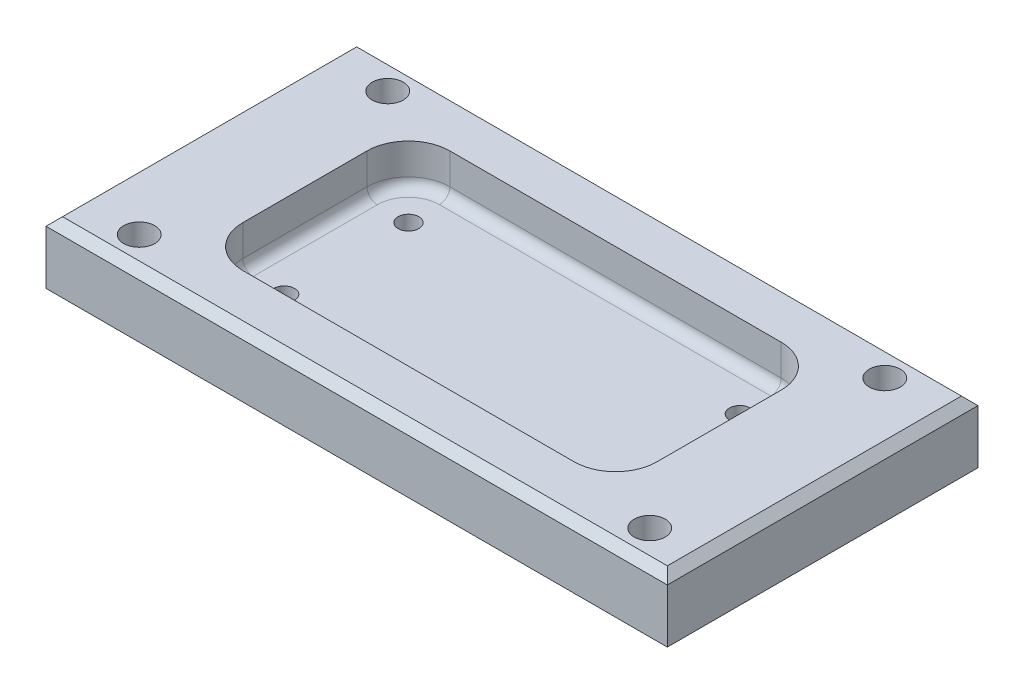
ISO-10303-21;
HEADER;
FILE_DESCRIPTION(('STEP AP214'),'2;1');
FILE_NAME('part.step','',(''),(''),'','','');
FILE_SCHEMA(('AUTOMOTIVE_DESIGN { 1 0 10303 214 1 1 1 1 }'));
ENDSEC;
DATA;
#1=APPLICATION_CONTEXT('core data for automotive mechanical design processes');
#2=APPLICATION_PROTOCOL_DEFINITION('international standard','automotive_design',2000,#1);
#3=PRODUCT_CONTEXT('',#1,'mechanical');
#4=PRODUCT('Part','Part','',(#3));
#5=PRODUCT_RELATED_PRODUCT_CATEGORY('part','',(#4));
#6=PRODUCT_DEFINITION_FORMATION('','',#4);
#7=PRODUCT_DEFINITION_CONTEXT('part definition',#1,'design');
#8=PRODUCT_DEFINITION('design','',#6,#7);
#9=PRODUCT_DEFINITION_SHAPE('','',#8);
#10=(LENGTH_UNIT() NAMED_UNIT(*) SI_UNIT(.MILLI.,.METRE.));
#11=(NAMED_UNIT(*) PLANE_ANGLE_UNIT() SI_UNIT($,.RADIAN.));
#12=(NAMED_UNIT(*) SI_UNIT($,.STERADIAN.) SOLID_ANGLE_UNIT());
#13=UNCERTAINTY_MEASURE_WITH_UNIT(LENGTH_MEASURE(1.E-05),#10,'distance_accuracy_value','');
#14=(GEOMETRIC_REPRESENTATION_CONTEXT(3) GLOBAL_UNCERTAINTY_ASSIGNED_CONTEXT((#13)) GLOBAL_UNIT_ASSIGNED_CONTEXT((#10,
#11,#12)) REPRESENTATION_CONTEXT('',''));
#15=CARTESIAN_POINT('',(0.,0.,0.));
#16=DIRECTION('',(0.,0.,1.));
#17=DIRECTION('',(1.,0.,0.));
#18=AXIS2_PLACEMENT_3D('',#15,#16,#17);
#19=CARTESIAN_POINT('',(75.,15.,37.5));
#20=DIRECTION('',(-1.,0.,0.));
#21=DIRECTION('',(0.,0.,1.));
#22=AXIS2_PLACEMENT_3D('',#19,#20,#21);
#23=PLANE('',#22);
#24=DIRECTION('',(0.,-1.,0.));
#25=VECTOR('',#24,1.);
#26=CARTESIAN_POINT('',(75.,15.,-37.5));
#27=LINE('',#26,#25);
#28=CARTESIAN_POINT('',(75.,13.,-37.5));
#29=VERTEX_POINT('',#28);
#30=CARTESIAN_POINT('',(75.,0.,-37.5));
#31=VERTEX_POINT('',#30);
#32=EDGE_CURVE('E157',#29,#31,#27,.T.);
#33=ORIENTED_EDGE('',*,*,#32,.F.);
#34=DIRECTION('',(0.,0.,1.));
#35=VECTOR('',#34,1.);
#36=CARTESIAN_POINT('',(75.,13.,37.5));
#37=LINE('',#36,#35);
#38=CARTESIAN_POINT('',(75.,13.,37.5));
#39=VERTEX_POINT('',#38);
#40=EDGE_CURVE('E288',#29,#39,#37,.T.);
#41=ORIENTED_EDGE('',*,*,#40,.T.);
#42=DIRECTION('',(0.,-1.,0.));
#43=VECTOR('',#42,1.);
#44=CARTESIAN_POINT('',(75.,15.,37.5));
#45=LINE('',#44,#43);
#46=CARTESIAN_POINT('',(75.,0.,37.5));
#47=VERTEX_POINT('',#46);
#48=EDGE_CURVE('E179',#39,#47,#45,.T.);
#49=ORIENTED_EDGE('',*,*,#48,.T.);
#50=DIRECTION('',(0.,0.,-1.));
#51=VECTOR('',#50,1.);
#52=CARTESIAN_POINT('',(75.,0.,37.5));
#53=LINE('',#52,#51);
#54=EDGE_CURVE('E175',#47,#31,#53,.T.);
#55=ORIENTED_EDGE('',*,*,#54,.T.);
#56=EDGE_LOOP('',(#33,#41,#49,#55));
#57=FACE_BOUND('',#56,.T.);
#58=ADVANCED_FACE('F32',(#57),#23,.F.);
#59=CARTESIAN_POINT('',(-75.,15.,-37.5));
#60=DIRECTION('',(0.,0.,1.));
#61=DIRECTION('',(1.,0.,0.));
#62=AXIS2_PLACEMENT_3D('',#59,#60,#61);
#63=PLANE('',#62);
#64=DIRECTION('',(0.,-1.,0.));
#65=VECTOR('',#64,1.);
#66=CARTESIAN_POINT('',(-75.,15.,-37.5));
#67=LINE('',#66,#65);
#68=CARTESIAN_POINT('',(-75.,13.,-37.5));
#69=VERTEX_POINT('',#68);
#70=CARTESIAN_POINT('',(-75.,0.,-37.5));
#71=VERTEX_POINT('',#70);
#72=EDGE_CURVE('E169',#69,#71,#67,.T.);
#73=ORIENTED_EDGE('',*,*,#72,.F.);
#74=DIRECTION('',(1.,0.,0.));
#75=VECTOR('',#74,1.);
#76=CARTESIAN_POINT('',(-75.,13.,-37.5));
#77=LINE('',#76,#75);
#78=EDGE_CURVE('E163',#69,#29,#77,.T.);
#79=ORIENTED_EDGE('',*,*,#78,.T.);
#80=ORIENTED_EDGE('',*,*,#32,.T.);
#81=DIRECTION('',(-1.,0.,0.));
#82=VECTOR('',#81,1.);
#83=CARTESIAN_POINT('',(-75.,0.,-37.5));
#84=LINE('',#83,#82);
#85=EDGE_CURVE('E160',#31,#71,#84,.T.);
#86=ORIENTED_EDGE('',*,*,#85,.T.);
#87=EDGE_LOOP('',(#73,#79,#80,#86));
#88=FACE_BOUND('',#87,.T.);
#89=ADVANCED_FACE('F159',(#88),#63,.F.);
#90=CARTESIAN_POINT('',(-75.,15.,37.5));
#91=DIRECTION('',(1.,0.,0.));
#92=DIRECTION('',(0.,0.,-1.));
#93=AXIS2_PLACEMENT_3D('',#90,#91,#92);
#94=PLANE('',#93);
#95=DIRECTION('',(0.,-1.,0.));
#96=VECTOR('',#95,1.);
#97=CARTESIAN_POINT('',(-75.,15.,37.5));
#98=LINE('',#97,#96);
#99=CARTESIAN_POINT('',(-75.,13.,37.5));
#100=VERTEX_POINT('',#99);
#101=CARTESIAN_POINT('',(-75.,0.,37.5));
#102=VERTEX_POINT('',#101);
#103=EDGE_CURVE('E192',#100,#102,#98,.T.);
#104=ORIENTED_EDGE('',*,*,#103,.F.);
#105=DIRECTION('',(0.,0.,-1.));
#106=VECTOR('',#105,1.);
#107=CARTESIAN_POINT('',(-75.,13.,37.5));
#108=LINE('',#107,#106);
#109=EDGE_CURVE('E41',#100,#69,#108,.T.);
#110=ORIENTED_EDGE('',*,*,#109,.T.);
#111=ORIENTED_EDGE('',*,*,#72,.T.);
#112=DIRECTION('',(0.,0.,1.));
#113=VECTOR('',#112,1.);
#114=CARTESIAN_POINT('',(-75.,0.,37.5));
#115=LINE('',#114,#113);
#116=EDGE_CURVE('E177',#71,#102,#115,.T.);
#117=ORIENTED_EDGE('',*,*,#116,.T.);
#118=EDGE_LOOP('',(#104,#110,#111,#117));
#119=FACE_BOUND('',#118,.T.);
#120=ADVANCED_FACE('F314',(#119),#94,.F.);
#121=CARTESIAN_POINT('',(-75.,15.,37.5));
#122=DIRECTION('',(0.,0.,-1.));
#123=DIRECTION('',(-1.,0.,0.));
#124=AXIS2_PLACEMENT_3D('',#121,#122,#123);
#125=PLANE('',#124);
#126=ORIENTED_EDGE('',*,*,#48,.F.);
#127=DIRECTION('',(-1.,0.,0.));
#128=VECTOR('',#127,1.);
#129=CARTESIAN_POINT('',(-75.,13.,37.5));
#130=LINE('',#129,#128);
#131=EDGE_CURVE('E11',#39,#100,#130,.T.);
#132=ORIENTED_EDGE('',*,*,#131,.T.);
#133=ORIENTED_EDGE('',*,*,#103,.T.);
#134=DIRECTION('',(1.,0.,0.));
#135=VECTOR('',#134,1.);
#136=CARTESIAN_POINT('',(-75.,0.,37.5));
#137=LINE('',#136,#135);
#138=EDGE_CURVE('E189',#102,#47,#137,.T.);
#139=ORIENTED_EDGE('',*,*,#138,.T.);
#140=EDGE_LOOP('',(#126,#132,#133,#139));
#141=FACE_BOUND('',#140,.T.);
#142=ADVANCED_FACE('F313',(#141),#125,.F.);
#143=CARTESIAN_POINT('',(75.,15.,-37.5));
#144=DIRECTION('',(0.,-1.,0.));
#145=DIRECTION('',(0.,0.,-1.));
#146=AXIS2_PLACEMENT_3D('',#143,#144,#145);
#147=PLANE('',#146);
#148=DIRECTION('',(1.,0.,0.));
#149=VECTOR('',#148,1.);
#150=CARTESIAN_POINT('',(75.,15.,35.5));
#151=LINE('',#150,#149);
#152=CARTESIAN_POINT('',(-73.,15.,35.5));
#153=VERTEX_POINT('',#152);
#154=CARTESIAN_POINT('',(73.,15.,35.5));
#155=VERTEX_POINT('',#154);
#156=EDGE_CURVE('E256',#153,#155,#151,.T.);
#157=ORIENTED_EDGE('',*,*,#156,.T.);
#158=DIRECTION('',(0.,0.,-1.));
#159=VECTOR('',#158,1.);
#160=CARTESIAN_POINT('',(73.,15.,-37.5));
#161=LINE('',#160,#159);
#162=CARTESIAN_POINT('',(73.,15.,-35.5));
#163=VERTEX_POINT('',#162);
#164=EDGE_CURVE('E285',#155,#163,#161,.T.);
#165=ORIENTED_EDGE('',*,*,#164,.T.);
#166=DIRECTION('',(-1.,0.,0.));
#167=VECTOR('',#166,1.);
#168=CARTESIAN_POINT('',(75.,15.,-35.5));
#169=LINE('',#168,#167);
#170=CARTESIAN_POINT('',(-73.,15.,-35.5));
#171=VERTEX_POINT('',#170);
#172=EDGE_CURVE('E283',#163,#171,#169,.T.);
#173=ORIENTED_EDGE('',*,*,#172,.T.);
#174=DIRECTION('',(0.,0.,1.));
#175=VECTOR('',#174,1.);
#176=CARTESIAN_POINT('',(-73.,15.,-37.5));
#177=LINE('',#176,#175);
#178=EDGE_CURVE('E281',#171,#153,#177,.T.);
#179=ORIENTED_EDGE('',*,*,#178,.T.);
#180=EDGE_LOOP('',(#157,#165,#173,#179));
#181=FACE_BOUND('',#180,.T.);
#182=CARTESIAN_POINT('',(62.9823856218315,15.,29.7355862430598));
#183=DIRECTION('',(0.,1.,0.));
#184=DIRECTION('',(0.,0.,1.));
#185=AXIS2_PLACEMENT_3D('',#182,#183,#184);
#186=CIRCLE('',#185,3.75000000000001);
#187=CARTESIAN_POINT('',(62.9823856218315,15.,33.4855862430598));
#188=VERTEX_POINT('',#187);
#189=EDGE_CURVE('E650',#188,#188,#186,.T.);
#190=ORIENTED_EDGE('',*,*,#189,.F.);
#191=EDGE_LOOP('',(#190));
#192=FACE_BOUND('',#191,.T.);
#193=CARTESIAN_POINT('',(60.,15.,-30.));
#194=DIRECTION('',(0.,1.,0.));
#195=DIRECTION('',(0.,0.,1.));
#196=AXIS2_PLACEMENT_3D('',#193,#194,#195);
#197=CIRCLE('',#196,3.75000000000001);
#198=CARTESIAN_POINT('',(60.,15.,-26.25));
#199=VERTEX_POINT('',#198);
#200=EDGE_CURVE('E654',#199,#199,#197,.T.);
#201=ORIENTED_EDGE('',*,*,#200,.F.);
#202=EDGE_LOOP('',(#201));
#203=FACE_BOUND('',#202,.T.);
#204=CARTESIAN_POINT('',(-60.,15.,30.));
#205=DIRECTION('',(0.,1.,0.));
#206=DIRECTION('',(0.,0.,1.));
#207=AXIS2_PLACEMENT_3D('',#204,#205,#206);
#208=CIRCLE('',#207,3.75);
#209=CARTESIAN_POINT('',(-60.,15.,33.75));
#210=VERTEX_POINT('',#209);
#211=EDGE_CURVE('E658',#210,#210,#208,.T.);
#212=ORIENTED_EDGE('',*,*,#211,.F.);
#213=EDGE_LOOP('',(#212));
#214=FACE_BOUND('',#213,.T.);
#215=CARTESIAN_POINT('',(-60.,15.,-30.));
#216=DIRECTION('',(0.,1.,0.));
#217=DIRECTION('',(0.,0.,1.));
#218=AXIS2_PLACEMENT_3D('',#215,#216,#217);
#219=CIRCLE('',#218,3.75000000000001);
#220=CARTESIAN_POINT('',(-60.,15.,-26.25));
#221=VERTEX_POINT('',#220);
#222=EDGE_CURVE('E662',#221,#221,#219,.T.);
#223=ORIENTED_EDGE('',*,*,#222,.F.);
#224=EDGE_LOOP('',(#223));
#225=FACE_BOUND('',#224,.T.);
#226=DIRECTION('',(-1.,0.,0.));
#227=VECTOR('',#226,1.);
#228=CARTESIAN_POINT('',(-50.,15.,-25.));
#229=LINE('',#228,#227);
#230=CARTESIAN_POINT('',(40.,15.,-25.));
#231=VERTEX_POINT('',#230);
#232=CARTESIAN_POINT('',(-40.,15.,-25.));
#233=VERTEX_POINT('',#232);
#234=EDGE_CURVE('E665',#231,#233,#229,.T.);
#235=ORIENTED_EDGE('',*,*,#234,.F.);
#236=CARTESIAN_POINT('',(40.,15.,-15.));
#237=DIRECTION('',(0.,-1.,0.));
#238=DIRECTION('',(0.,0.,-1.));
#239=AXIS2_PLACEMENT_3D('',#236,#237,#238);
#240=CIRCLE('',#239,10.);
#241=CARTESIAN_POINT('',(50.,15.,-15.));
#242=VERTEX_POINT('',#241);
#243=EDGE_CURVE('E218',#231,#242,#240,.T.);
#244=ORIENTED_EDGE('',*,*,#243,.T.);
#245=DIRECTION('',(0.,0.,-1.));
#246=VECTOR('',#245,1.);
#247=CARTESIAN_POINT('',(50.,15.,25.));
#248=LINE('',#247,#246);
#249=CARTESIAN_POINT('',(50.,15.,15.));
#250=VERTEX_POINT('',#249);
#251=EDGE_CURVE('E672',#250,#242,#248,.T.);
#252=ORIENTED_EDGE('',*,*,#251,.F.);
#253=CARTESIAN_POINT('',(40.,15.,15.));
#254=DIRECTION('',(0.,-1.,0.));
#255=DIRECTION('',(0.,0.,-1.));
#256=AXIS2_PLACEMENT_3D('',#253,#254,#255);
#257=CIRCLE('',#256,10.);
#258=CARTESIAN_POINT('',(40.,15.,25.));
#259=VERTEX_POINT('',#258);
#260=EDGE_CURVE('E216',#250,#259,#257,.T.);
#261=ORIENTED_EDGE('',*,*,#260,.T.);
#262=DIRECTION('',(1.,0.,0.));
#263=VECTOR('',#262,1.);
#264=CARTESIAN_POINT('',(-50.,15.,25.));
#265=LINE('',#264,#263);
#266=CARTESIAN_POINT('',(-40.,15.,25.));
#267=VERTEX_POINT('',#266);
#268=EDGE_CURVE('E181',#267,#259,#265,.T.);
#269=ORIENTED_EDGE('',*,*,#268,.F.);
#270=CARTESIAN_POINT('',(-40.,15.,15.));
#271=DIRECTION('',(0.,-1.,0.));
#272=DIRECTION('',(0.,0.,-1.));
#273=AXIS2_PLACEMENT_3D('',#270,#271,#272);
#274=CIRCLE('',#273,10.);
#275=CARTESIAN_POINT('',(-50.,15.,15.));
#276=VERTEX_POINT('',#275);
#277=EDGE_CURVE('E214',#267,#276,#274,.T.);
#278=ORIENTED_EDGE('',*,*,#277,.T.);
#279=DIRECTION('',(0.,0.,1.));
#280=VECTOR('',#279,1.);
#281=CARTESIAN_POINT('',(-50.,15.,25.));
#282=LINE('',#281,#280);
#283=CARTESIAN_POINT('',(-50.,15.,-15.));
#284=VERTEX_POINT('',#283);
#285=EDGE_CURVE('E184',#284,#276,#282,.T.);
#286=ORIENTED_EDGE('',*,*,#285,.F.);
#287=CARTESIAN_POINT('',(-40.,15.,-15.));
#288=DIRECTION('',(0.,-1.,0.));
#289=DIRECTION('',(0.,0.,-1.));
#290=AXIS2_PLACEMENT_3D('',#287,#288,#289);
#291=CIRCLE('',#290,10.);
#292=EDGE_CURVE('E220',#284,#233,#291,.T.);
#293=ORIENTED_EDGE('',*,*,#292,.T.);
#294=EDGE_LOOP('',(#235,#244,#252,#261,#269,#278,#286,#293));
#295=FACE_BOUND('',#294,.T.);
#296=ADVANCED_FACE('F321',(#181,#192,#203,#214,#225,#295),#147,.F.);
#297=CARTESIAN_POINT('',(75.,0.,-37.5));
#298=DIRECTION('',(0.,-1.,0.));
#299=DIRECTION('',(0.,0.,-1.));
#300=AXIS2_PLACEMENT_3D('',#297,#298,#299);
#301=PLANE('',#300);
#302=CARTESIAN_POINT('',(40.,0.,15.));
#303=DIRECTION('',(0.,-1.,0.));
#304=DIRECTION('',(0.,0.,-1.));
#305=AXIS2_PLACEMENT_3D('',#302,#303,#304);
#306=CIRCLE('',#305,2.5);
#307=CARTESIAN_POINT('',(40.,0.,12.5));
#308=VERTEX_POINT('',#307);
#309=EDGE_CURVE('E711',#308,#308,#306,.T.);
#310=ORIENTED_EDGE('',*,*,#309,.F.);
#311=EDGE_LOOP('',(#310));
#312=FACE_BOUND('',#311,.T.);
#313=CARTESIAN_POINT('',(40.,0.,-15.));
#314=DIRECTION('',(0.,-1.,0.));
#315=DIRECTION('',(0.,0.,-1.));
#316=AXIS2_PLACEMENT_3D('',#313,#314,#315);
#317=CIRCLE('',#316,2.5);
#318=CARTESIAN_POINT('',(40.,0.,-17.5));
#319=VERTEX_POINT('',#318);
#320=EDGE_CURVE('E705',#319,#319,#317,.T.);
#321=ORIENTED_EDGE('',*,*,#320,.F.);
#322=EDGE_LOOP('',(#321));
#323=FACE_BOUND('',#322,.T.);
#324=CARTESIAN_POINT('',(-40.,0.,15.));
#325=DIRECTION('',(0.,-1.,0.));
#326=DIRECTION('',(0.,0.,-1.));
#327=AXIS2_PLACEMENT_3D('',#324,#325,#326);
#328=CIRCLE('',#327,2.5);
#329=CARTESIAN_POINT('',(-40.,0.,12.5));
#330=VERTEX_POINT('',#329);
#331=EDGE_CURVE('E699',#330,#330,#328,.T.);
#332=ORIENTED_EDGE('',*,*,#331,.F.);
#333=EDGE_LOOP('',(#332));
#334=FACE_BOUND('',#333,.T.);
#335=CARTESIAN_POINT('',(-40.,0.,-15.));
#336=DIRECTION('',(0.,-1.,0.));
#337=DIRECTION('',(0.,0.,-1.));
#338=AXIS2_PLACEMENT_3D('',#335,#336,#337);
#339=CIRCLE('',#338,2.5);
#340=CARTESIAN_POINT('',(-40.,0.,-17.5));
#341=VERTEX_POINT('',#340);
#342=EDGE_CURVE('E691',#341,#341,#339,.T.);
#343=ORIENTED_EDGE('',*,*,#342,.F.);
#344=EDGE_LOOP('',(#343));
#345=FACE_BOUND('',#344,.T.);
#346=CARTESIAN_POINT('',(62.9823856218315,0.,29.7355862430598));
#347=DIRECTION('',(0.,1.,0.));
#348=DIRECTION('',(0.,0.,1.));
#349=AXIS2_PLACEMENT_3D('',#346,#347,#348);
#350=CIRCLE('',#349,3.75000000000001);
#351=CARTESIAN_POINT('',(62.9823856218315,0.,33.4855862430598));
#352=VERTEX_POINT('',#351);
#353=EDGE_CURVE('E687',#352,#352,#350,.T.);
#354=ORIENTED_EDGE('',*,*,#353,.T.);
#355=EDGE_LOOP('',(#354));
#356=FACE_BOUND('',#355,.T.);
#357=CARTESIAN_POINT('',(60.,0.,-30.));
#358=DIRECTION('',(0.,1.,0.));
#359=DIRECTION('',(0.,0.,1.));
#360=AXIS2_PLACEMENT_3D('',#357,#358,#359);
#361=CIRCLE('',#360,3.75000000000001);
#362=CARTESIAN_POINT('',(60.,0.,-26.25));
#363=VERTEX_POINT('',#362);
#364=EDGE_CURVE('E683',#363,#363,#361,.T.);
#365=ORIENTED_EDGE('',*,*,#364,.T.);
#366=EDGE_LOOP('',(#365));
#367=FACE_BOUND('',#366,.T.);
#368=CARTESIAN_POINT('',(-60.,0.,30.));
#369=DIRECTION('',(0.,1.,0.));
#370=DIRECTION('',(0.,0.,1.));
#371=AXIS2_PLACEMENT_3D('',#368,#369,#370);
#372=CIRCLE('',#371,3.75);
#373=CARTESIAN_POINT('',(-60.,0.,33.75));
#374=VERTEX_POINT('',#373);
#375=EDGE_CURVE('E679',#374,#374,#372,.T.);
#376=ORIENTED_EDGE('',*,*,#375,.T.);
#377=EDGE_LOOP('',(#376));
#378=FACE_BOUND('',#377,.T.);
#379=CARTESIAN_POINT('',(-60.,0.,-30.));
#380=DIRECTION('',(0.,1.,0.));
#381=DIRECTION('',(0.,0.,1.));
#382=AXIS2_PLACEMENT_3D('',#379,#380,#381);
#383=CIRCLE('',#382,3.75000000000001);
#384=CARTESIAN_POINT('',(-60.,0.,-26.25));
#385=VERTEX_POINT('',#384);
#386=EDGE_CURVE('E675',#385,#385,#383,.T.);
#387=ORIENTED_EDGE('',*,*,#386,.T.);
#388=EDGE_LOOP('',(#387));
#389=FACE_BOUND('',#388,.T.);
#390=ORIENTED_EDGE('',*,*,#54,.F.);
#391=ORIENTED_EDGE('',*,*,#138,.F.);
#392=ORIENTED_EDGE('',*,*,#116,.F.);
#393=ORIENTED_EDGE('',*,*,#85,.F.);
#394=EDGE_LOOP('',(#390,#391,#392,#393));
#395=FACE_BOUND('',#394,.T.);
#396=ADVANCED_FACE('F173',(#312,#323,#334,#345,#356,#367,#378,#389,#395),#301,.T.);
#397=CARTESIAN_POINT('',(50.,5.,25.));
#398=DIRECTION('',(1.,0.,0.));
#399=DIRECTION('',(0.,0.,-1.));
#400=AXIS2_PLACEMENT_3D('',#397,#398,#399);
#401=PLANE('',#400);
#402=DIRECTION('',(0.,1.,0.));
#403=VECTOR('',#402,1.);
#404=CARTESIAN_POINT('',(50.,5.,-15.));
#405=LINE('',#404,#403);
#406=CARTESIAN_POINT('',(50.,7.5,-15.));
#407=VERTEX_POINT('',#406);
#408=EDGE_CURVE('E204',#242,#407,#405,.F.);
#409=ORIENTED_EDGE('',*,*,#408,.T.);
#410=DIRECTION('',(0.,0.,-1.));
#411=VECTOR('',#410,1.);
#412=CARTESIAN_POINT('',(50.,7.5,15.));
#413=LINE('',#412,#411);
#414=CARTESIAN_POINT('',(50.,7.5,15.));
#415=VERTEX_POINT('',#414);
#416=EDGE_CURVE('E242',#407,#415,#413,.F.);
#417=ORIENTED_EDGE('',*,*,#416,.T.);
#418=DIRECTION('',(0.,1.,0.));
#419=VECTOR('',#418,1.);
#420=CARTESIAN_POINT('',(50.,15.,15.));
#421=LINE('',#420,#419);
#422=EDGE_CURVE('E207',#415,#250,#421,.T.);
#423=ORIENTED_EDGE('',*,*,#422,.T.);
#424=ORIENTED_EDGE('',*,*,#251,.T.);
#425=EDGE_LOOP('',(#409,#417,#423,#424));
#426=FACE_BOUND('',#425,.T.);
#427=ADVANCED_FACE('F532',(#426),#401,.F.);
#428=CARTESIAN_POINT('',(-50.,5.,25.));
#429=DIRECTION('',(0.,0.,1.));
#430=DIRECTION('',(1.,0.,0.));
#431=AXIS2_PLACEMENT_3D('',#428,#429,#430);
#432=PLANE('',#431);
#433=DIRECTION('',(0.,1.,0.));
#434=VECTOR('',#433,1.);
#435=CARTESIAN_POINT('',(40.,5.,25.));
#436=LINE('',#435,#434);
#437=CARTESIAN_POINT('',(40.,7.5,25.));
#438=VERTEX_POINT('',#437);
#439=EDGE_CURVE('E168',#259,#438,#436,.F.);
#440=ORIENTED_EDGE('',*,*,#439,.T.);
#441=DIRECTION('',(1.,0.,0.));
#442=VECTOR('',#441,1.);
#443=CARTESIAN_POINT('',(-40.,7.5,25.));
#444=LINE('',#443,#442);
#445=CARTESIAN_POINT('',(-40.,7.5,25.));
#446=VERTEX_POINT('',#445);
#447=EDGE_CURVE('E246',#438,#446,#444,.F.);
#448=ORIENTED_EDGE('',*,*,#447,.T.);
#449=DIRECTION('',(0.,1.,0.));
#450=VECTOR('',#449,1.);
#451=CARTESIAN_POINT('',(-40.,15.,25.));
#452=LINE('',#451,#450);
#453=EDGE_CURVE('E197',#446,#267,#452,.T.);
#454=ORIENTED_EDGE('',*,*,#453,.T.);
#455=ORIENTED_EDGE('',*,*,#268,.T.);
#456=EDGE_LOOP('',(#440,#448,#454,#455));
#457=FACE_BOUND('',#456,.T.);
#458=ADVANCED_FACE('F524',(#457),#432,.F.);
#459=CARTESIAN_POINT('',(-50.,5.,25.));
#460=DIRECTION('',(-1.,0.,0.));
#461=DIRECTION('',(0.,0.,1.));
#462=AXIS2_PLACEMENT_3D('',#459,#460,#461);
#463=PLANE('',#462);
#464=DIRECTION('',(0.,1.,0.));
#465=VECTOR('',#464,1.);
#466=CARTESIAN_POINT('',(-50.,5.,15.));
#467=LINE('',#466,#465);
#468=CARTESIAN_POINT('',(-50.,7.5,15.));
#469=VERTEX_POINT('',#468);
#470=EDGE_CURVE('E201',#276,#469,#467,.F.);
#471=ORIENTED_EDGE('',*,*,#470,.T.);
#472=DIRECTION('',(0.,0.,1.));
#473=VECTOR('',#472,1.);
#474=CARTESIAN_POINT('',(-50.,7.5,-15.));
#475=LINE('',#474,#473);
#476=CARTESIAN_POINT('',(-50.,7.5,-15.));
#477=VERTEX_POINT('',#476);
#478=EDGE_CURVE('E250',#469,#477,#475,.F.);
#479=ORIENTED_EDGE('',*,*,#478,.T.);
#480=DIRECTION('',(0.,1.,0.));
#481=VECTOR('',#480,1.);
#482=CARTESIAN_POINT('',(-50.,15.,-15.));
#483=LINE('',#482,#481);
#484=EDGE_CURVE('E199',#477,#284,#483,.T.);
#485=ORIENTED_EDGE('',*,*,#484,.T.);
#486=ORIENTED_EDGE('',*,*,#285,.T.);
#487=EDGE_LOOP('',(#471,#479,#485,#486));
#488=FACE_BOUND('',#487,.T.);
#489=ADVANCED_FACE('F516',(#488),#463,.F.);
#490=CARTESIAN_POINT('',(-50.,5.,-25.));
#491=DIRECTION('',(0.,0.,-1.));
#492=DIRECTION('',(-1.,0.,0.));
#493=AXIS2_PLACEMENT_3D('',#490,#491,#492);
#494=PLANE('',#493);
#495=DIRECTION('',(0.,1.,0.));
#496=VECTOR('',#495,1.);
#497=CARTESIAN_POINT('',(-40.,5.,-25.));
#498=LINE('',#497,#496);
#499=CARTESIAN_POINT('',(-40.,7.5,-25.));
#500=VERTEX_POINT('',#499);
#501=EDGE_CURVE('E209',#233,#500,#498,.F.);
#502=ORIENTED_EDGE('',*,*,#501,.T.);
#503=DIRECTION('',(-1.,0.,0.));
#504=VECTOR('',#503,1.);
#505=CARTESIAN_POINT('',(40.,7.5,-25.));
#506=LINE('',#505,#504);
#507=CARTESIAN_POINT('',(40.,7.5,-25.));
#508=VERTEX_POINT('',#507);
#509=EDGE_CURVE('E254',#500,#508,#506,.F.);
#510=ORIENTED_EDGE('',*,*,#509,.T.);
#511=DIRECTION('',(0.,1.,0.));
#512=VECTOR('',#511,1.);
#513=CARTESIAN_POINT('',(40.,15.,-25.));
#514=LINE('',#513,#512);
#515=EDGE_CURVE('E212',#508,#231,#514,.T.);
#516=ORIENTED_EDGE('',*,*,#515,.T.);
#517=ORIENTED_EDGE('',*,*,#234,.T.);
#518=EDGE_LOOP('',(#502,#510,#516,#517));
#519=FACE_BOUND('',#518,.T.);
#520=ADVANCED_FACE('F508',(#519),#494,.F.);
#521=CARTESIAN_POINT('',(50.,5.,-25.));
#522=DIRECTION('',(0.,-1.,0.));
#523=DIRECTION('',(0.,0.,-1.));
#524=AXIS2_PLACEMENT_3D('',#521,#522,#523);
#525=PLANE('',#524);
#526=DIRECTION('',(0.,0.,-1.));
#527=VECTOR('',#526,1.);
#528=CARTESIAN_POINT('',(47.5,5.,-15.));
#529=LINE('',#528,#527);
#530=CARTESIAN_POINT('',(47.5,5.,15.));
#531=VERTEX_POINT('',#530);
#532=CARTESIAN_POINT('',(47.5,5.,-15.));
#533=VERTEX_POINT('',#532);
#534=EDGE_CURVE('E234',#531,#533,#529,.T.);
#535=ORIENTED_EDGE('',*,*,#534,.T.);
#536=CARTESIAN_POINT('',(40.,5.,-15.));
#537=DIRECTION('',(0.,-1.,0.));
#538=DIRECTION('',(0.,0.,-1.));
#539=AXIS2_PLACEMENT_3D('',#536,#537,#538);
#540=CIRCLE('',#539,7.5);
#541=CARTESIAN_POINT('',(40.,5.,-22.5));
#542=VERTEX_POINT('',#541);
#543=EDGE_CURVE('E236',#533,#542,#540,.F.);
#544=ORIENTED_EDGE('',*,*,#543,.T.);
#545=DIRECTION('',(-1.,0.,0.));
#546=VECTOR('',#545,1.);
#547=CARTESIAN_POINT('',(-40.,5.,-22.5));
#548=LINE('',#547,#546);
#549=CARTESIAN_POINT('',(-40.,5.,-22.5));
#550=VERTEX_POINT('',#549);
#551=EDGE_CURVE('E222',#542,#550,#548,.T.);
#552=ORIENTED_EDGE('',*,*,#551,.T.);
#553=CARTESIAN_POINT('',(-40.,5.,-15.));
#554=DIRECTION('',(0.,-1.,0.));
#555=DIRECTION('',(0.,0.,-1.));
#556=AXIS2_PLACEMENT_3D('',#553,#554,#555);
#557=CIRCLE('',#556,7.5);
#558=CARTESIAN_POINT('',(-47.5,5.,-15.));
#559=VERTEX_POINT('',#558);
#560=EDGE_CURVE('E224',#550,#559,#557,.F.);
#561=ORIENTED_EDGE('',*,*,#560,.T.);
#562=DIRECTION('',(0.,0.,1.));
#563=VECTOR('',#562,1.);
#564=CARTESIAN_POINT('',(-47.5,5.,15.));
#565=LINE('',#564,#563);
#566=CARTESIAN_POINT('',(-47.5,5.,15.));
#567=VERTEX_POINT('',#566);
#568=EDGE_CURVE('E226',#559,#567,#565,.T.);
#569=ORIENTED_EDGE('',*,*,#568,.T.);
#570=CARTESIAN_POINT('',(-40.,5.,15.));
#571=DIRECTION('',(0.,-1.,0.));
#572=DIRECTION('',(0.,0.,-1.));
#573=AXIS2_PLACEMENT_3D('',#570,#571,#572);
#574=CIRCLE('',#573,7.5);
#575=CARTESIAN_POINT('',(-40.,5.,22.5));
#576=VERTEX_POINT('',#575);
#577=EDGE_CURVE('E228',#567,#576,#574,.F.);
#578=ORIENTED_EDGE('',*,*,#577,.T.);
#579=DIRECTION('',(1.,0.,0.));
#580=VECTOR('',#579,1.);
#581=CARTESIAN_POINT('',(40.,5.,22.5));
#582=LINE('',#581,#580);
#583=CARTESIAN_POINT('',(40.,5.,22.5));
#584=VERTEX_POINT('',#583);
#585=EDGE_CURVE('E230',#576,#584,#582,.T.);
#586=ORIENTED_EDGE('',*,*,#585,.T.);
#587=CARTESIAN_POINT('',(40.,5.,15.));
#588=DIRECTION('',(0.,-1.,0.));
#589=DIRECTION('',(0.,0.,-1.));
#590=AXIS2_PLACEMENT_3D('',#587,#588,#589);
#591=CIRCLE('',#590,7.5);
#592=EDGE_CURVE('E232',#584,#531,#591,.F.);
#593=ORIENTED_EDGE('',*,*,#592,.T.);
#594=EDGE_LOOP('',(#535,#544,#552,#561,#569,#578,#586,#593));
#595=FACE_BOUND('',#594,.T.);
#596=CARTESIAN_POINT('',(40.,5.,15.));
#597=DIRECTION('',(0.,1.,0.));
#598=DIRECTION('',(0.,0.,1.));
#599=AXIS2_PLACEMENT_3D('',#596,#597,#598);
#600=CIRCLE('',#599,2.5);
#601=CARTESIAN_POINT('',(40.,5.,17.5));
#602=VERTEX_POINT('',#601);
#603=EDGE_CURVE('E279',#602,#602,#600,.T.);
#604=ORIENTED_EDGE('',*,*,#603,.F.);
#605=EDGE_LOOP('',(#604));
#606=FACE_BOUND('',#605,.T.);
#607=CARTESIAN_POINT('',(40.,5.,-15.));
#608=DIRECTION('',(0.,1.,0.));
#609=DIRECTION('',(0.,0.,1.));
#610=AXIS2_PLACEMENT_3D('',#607,#608,#609);
#611=CIRCLE('',#610,2.5);
#612=CARTESIAN_POINT('',(40.,5.,-12.5));
#613=VERTEX_POINT('',#612);
#614=EDGE_CURVE('E708',#613,#613,#611,.T.);
#615=ORIENTED_EDGE('',*,*,#614,.F.);
#616=EDGE_LOOP('',(#615));
#617=FACE_BOUND('',#616,.T.);
#618=CARTESIAN_POINT('',(-40.,5.,15.));
#619=DIRECTION('',(0.,1.,0.));
#620=DIRECTION('',(0.,0.,1.));
#621=AXIS2_PLACEMENT_3D('',#618,#619,#620);
#622=CIRCLE('',#621,2.5);
#623=CARTESIAN_POINT('',(-40.,5.,17.5));
#624=VERTEX_POINT('',#623);
#625=EDGE_CURVE('E702',#624,#624,#622,.T.);
#626=ORIENTED_EDGE('',*,*,#625,.F.);
#627=EDGE_LOOP('',(#626));
#628=FACE_BOUND('',#627,.T.);
#629=CARTESIAN_POINT('',(-40.,5.,-15.));
#630=DIRECTION('',(0.,1.,0.));
#631=DIRECTION('',(0.,0.,1.));
#632=AXIS2_PLACEMENT_3D('',#629,#630,#631);
#633=CIRCLE('',#632,2.5);
#634=CARTESIAN_POINT('',(-40.,5.,-12.5));
#635=VERTEX_POINT('',#634);
#636=EDGE_CURVE('E696',#635,#635,#633,.T.);
#637=ORIENTED_EDGE('',*,*,#636,.F.);
#638=EDGE_LOOP('',(#637));
#639=FACE_BOUND('',#638,.T.);
#640=ADVANCED_FACE('F501',(#595,#606,#617,#628,#639),#525,.F.);
#641=CARTESIAN_POINT('',(-60.,0.,-30.));
#642=DIRECTION('',(0.,1.,0.));
#643=DIRECTION('',(0.,0.,1.));
#644=AXIS2_PLACEMENT_3D('',#641,#642,#643);
#645=CYLINDRICAL_SURFACE('',#644,3.75000000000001);
#646=ORIENTED_EDGE('',*,*,#386,.F.);
#647=EDGE_LOOP('',(#646));
#648=FACE_BOUND('',#647,.T.);
#649=ORIENTED_EDGE('',*,*,#222,.T.);
#650=EDGE_LOOP('',(#649));
#651=FACE_BOUND('',#650,.T.);
#652=ADVANCED_FACE('F493',(#648,#651),#645,.F.);
#653=CARTESIAN_POINT('',(-60.,0.,30.));
#654=DIRECTION('',(0.,1.,0.));
#655=DIRECTION('',(0.,0.,1.));
#656=AXIS2_PLACEMENT_3D('',#653,#654,#655);
#657=CYLINDRICAL_SURFACE('',#656,3.75);
#658=ORIENTED_EDGE('',*,*,#375,.F.);
#659=EDGE_LOOP('',(#658));
#660=FACE_BOUND('',#659,.T.);
#661=ORIENTED_EDGE('',*,*,#211,.T.);
#662=EDGE_LOOP('',(#661));
#663=FACE_BOUND('',#662,.T.);
#664=ADVANCED_FACE('F485',(#660,#663),#657,.F.);
#665=CARTESIAN_POINT('',(60.,0.,-30.));
#666=DIRECTION('',(0.,1.,0.));
#667=DIRECTION('',(0.,0.,1.));
#668=AXIS2_PLACEMENT_3D('',#665,#666,#667);
#669=CYLINDRICAL_SURFACE('',#668,3.75000000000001);
#670=ORIENTED_EDGE('',*,*,#364,.F.);
#671=EDGE_LOOP('',(#670));
#672=FACE_BOUND('',#671,.T.);
#673=ORIENTED_EDGE('',*,*,#200,.T.);
#674=EDGE_LOOP('',(#673));
#675=FACE_BOUND('',#674,.T.);
#676=ADVANCED_FACE('F477',(#672,#675),#669,.F.);
#677=CARTESIAN_POINT('',(62.9823856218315,0.,29.7355862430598));
#678=DIRECTION('',(0.,1.,0.));
#679=DIRECTION('',(0.,0.,1.));
#680=AXIS2_PLACEMENT_3D('',#677,#678,#679);
#681=CYLINDRICAL_SURFACE('',#680,3.75000000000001);
#682=ORIENTED_EDGE('',*,*,#353,.F.);
#683=EDGE_LOOP('',(#682));
#684=FACE_BOUND('',#683,.T.);
#685=ORIENTED_EDGE('',*,*,#189,.T.);
#686=EDGE_LOOP('',(#685));
#687=FACE_BOUND('',#686,.T.);
#688=ADVANCED_FACE('F333',(#684,#687),#681,.F.);
#689=CARTESIAN_POINT('',(-40.,5.,15.));
#690=DIRECTION('',(0.,-1.,0.));
#691=DIRECTION('',(0.,0.,-1.));
#692=AXIS2_PLACEMENT_3D('',#689,#690,#691);
#693=CYLINDRICAL_SURFACE('',#692,10.);
#694=ORIENTED_EDGE('',*,*,#453,.F.);
#695=CARTESIAN_POINT('',(-40.,7.5,15.));
#696=DIRECTION('',(0.,-1.,0.));
#697=DIRECTION('',(0.,0.,-1.));
#698=AXIS2_PLACEMENT_3D('',#695,#696,#697);
#699=CIRCLE('',#698,10.);
#700=EDGE_CURVE('E248',#446,#469,#699,.T.);
#701=ORIENTED_EDGE('',*,*,#700,.T.);
#702=ORIENTED_EDGE('',*,*,#470,.F.);
#703=ORIENTED_EDGE('',*,*,#277,.F.);
#704=EDGE_LOOP('',(#694,#701,#702,#703));
#705=FACE_BOUND('',#704,.T.);
#706=ADVANCED_FACE('F329',(#705),#693,.F.);
#707=CARTESIAN_POINT('',(40.,5.,15.));
#708=DIRECTION('',(0.,-1.,0.));
#709=DIRECTION('',(0.,0.,-1.));
#710=AXIS2_PLACEMENT_3D('',#707,#708,#709);
#711=CYLINDRICAL_SURFACE('',#710,10.);
#712=ORIENTED_EDGE('',*,*,#422,.F.);
#713=CARTESIAN_POINT('',(40.,7.5,15.));
#714=DIRECTION('',(0.,-1.,0.));
#715=DIRECTION('',(0.,0.,-1.));
#716=AXIS2_PLACEMENT_3D('',#713,#714,#715);
#717=CIRCLE('',#716,10.);
#718=EDGE_CURVE('E244',#415,#438,#717,.T.);
#719=ORIENTED_EDGE('',*,*,#718,.T.);
#720=ORIENTED_EDGE('',*,*,#439,.F.);
#721=ORIENTED_EDGE('',*,*,#260,.F.);
#722=EDGE_LOOP('',(#712,#719,#720,#721));
#723=FACE_BOUND('',#722,.T.);
#724=ADVANCED_FACE('F332',(#723),#711,.F.);
#725=CARTESIAN_POINT('',(40.,5.,-15.));
#726=DIRECTION('',(0.,-1.,0.));
#727=DIRECTION('',(0.,0.,-1.));
#728=AXIS2_PLACEMENT_3D('',#725,#726,#727);
#729=CYLINDRICAL_SURFACE('',#728,10.);
#730=ORIENTED_EDGE('',*,*,#515,.F.);
#731=CARTESIAN_POINT('',(40.,7.5,-15.));
#732=DIRECTION('',(0.,-1.,0.));
#733=DIRECTION('',(0.,0.,-1.));
#734=AXIS2_PLACEMENT_3D('',#731,#732,#733);
#735=CIRCLE('',#734,10.);
#736=EDGE_CURVE('E239',#508,#407,#735,.T.);
#737=ORIENTED_EDGE('',*,*,#736,.T.);
#738=ORIENTED_EDGE('',*,*,#408,.F.);
#739=ORIENTED_EDGE('',*,*,#243,.F.);
#740=EDGE_LOOP('',(#730,#737,#738,#739));
#741=FACE_BOUND('',#740,.T.);
#742=ADVANCED_FACE('F337',(#741),#729,.F.);
#743=CARTESIAN_POINT('',(-40.,5.,-15.));
#744=DIRECTION('',(0.,-1.,0.));
#745=DIRECTION('',(0.,0.,-1.));
#746=AXIS2_PLACEMENT_3D('',#743,#744,#745);
#747=CYLINDRICAL_SURFACE('',#746,10.);
#748=ORIENTED_EDGE('',*,*,#484,.F.);
#749=CARTESIAN_POINT('',(-40.,7.5,-15.));
#750=DIRECTION('',(0.,-1.,0.));
#751=DIRECTION('',(0.,0.,-1.));
#752=AXIS2_PLACEMENT_3D('',#749,#750,#751);
#753=CIRCLE('',#752,10.);
#754=EDGE_CURVE('E252',#477,#500,#753,.T.);
#755=ORIENTED_EDGE('',*,*,#754,.T.);
#756=ORIENTED_EDGE('',*,*,#501,.F.);
#757=ORIENTED_EDGE('',*,*,#292,.F.);
#758=EDGE_LOOP('',(#748,#755,#756,#757));
#759=FACE_BOUND('',#758,.T.);
#760=ADVANCED_FACE('F341',(#759),#747,.F.);
#761=CARTESIAN_POINT('',(-40.,-5.,-15.));
#762=DIRECTION('',(0.,1.,0.));
#763=DIRECTION('',(0.,0.,1.));
#764=AXIS2_PLACEMENT_3D('',#761,#762,#763);
#765=CYLINDRICAL_SURFACE('',#764,2.5);
#766=ORIENTED_EDGE('',*,*,#342,.T.);
#767=EDGE_LOOP('',(#766));
#768=FACE_BOUND('',#767,.T.);
#769=ORIENTED_EDGE('',*,*,#636,.T.);
#770=EDGE_LOOP('',(#769));
#771=FACE_BOUND('',#770,.T.);
#772=ADVANCED_FACE('F345',(#768,#771),#765,.F.);
#773=CARTESIAN_POINT('',(-40.,-5.,15.));
#774=DIRECTION('',(0.,1.,0.));
#775=DIRECTION('',(0.,0.,1.));
#776=AXIS2_PLACEMENT_3D('',#773,#774,#775);
#777=CYLINDRICAL_SURFACE('',#776,2.5);
#778=ORIENTED_EDGE('',*,*,#331,.T.);
#779=EDGE_LOOP('',(#778));
#780=FACE_BOUND('',#779,.T.);
#781=ORIENTED_EDGE('',*,*,#625,.T.);
#782=EDGE_LOOP('',(#781));
#783=FACE_BOUND('',#782,.T.);
#784=ADVANCED_FACE('F438',(#780,#783),#777,.F.);
#785=CARTESIAN_POINT('',(40.,-5.,-15.));
#786=DIRECTION('',(0.,1.,0.));
#787=DIRECTION('',(0.,0.,1.));
#788=AXIS2_PLACEMENT_3D('',#785,#786,#787);
#789=CYLINDRICAL_SURFACE('',#788,2.5);
#790=ORIENTED_EDGE('',*,*,#320,.T.);
#791=EDGE_LOOP('',(#790));
#792=FACE_BOUND('',#791,.T.);
#793=ORIENTED_EDGE('',*,*,#614,.T.);
#794=EDGE_LOOP('',(#793));
#795=FACE_BOUND('',#794,.T.);
#796=ADVANCED_FACE('F429',(#792,#795),#789,.F.);
#797=CARTESIAN_POINT('',(40.,-5.,15.));
#798=DIRECTION('',(0.,1.,0.));
#799=DIRECTION('',(0.,0.,1.));
#800=AXIS2_PLACEMENT_3D('',#797,#798,#799);
#801=CYLINDRICAL_SURFACE('',#800,2.5);
#802=ORIENTED_EDGE('',*,*,#309,.T.);
#803=EDGE_LOOP('',(#802));
#804=FACE_BOUND('',#803,.T.);
#805=ORIENTED_EDGE('',*,*,#603,.T.);
#806=EDGE_LOOP('',(#805));
#807=FACE_BOUND('',#806,.T.);
#808=ADVANCED_FACE('F378',(#804,#807),#801,.F.);
#809=CARTESIAN_POINT('',(-40.,7.5,15.));
#810=DIRECTION('',(0.,-1.,0.));
#811=DIRECTION('',(0.,0.,-1.));
#812=AXIS2_PLACEMENT_3D('',#809,#810,#811);
#813=TOROIDAL_SURFACE('',#812,7.5,2.5);
#814=CARTESIAN_POINT('',(-47.5,7.5,15.));
#815=DIRECTION('',(0.,0.,1.));
#816=DIRECTION('',(1.,0.,0.));
#817=AXIS2_PLACEMENT_3D('',#814,#815,#816);
#818=CIRCLE('',#817,2.5);
#819=EDGE_CURVE('E273',#469,#567,#818,.T.);
#820=ORIENTED_EDGE('',*,*,#819,.F.);
#821=ORIENTED_EDGE('',*,*,#700,.F.);
#822=CARTESIAN_POINT('',(-40.,7.5,22.5));
#823=DIRECTION('',(-1.,0.,0.));
#824=DIRECTION('',(0.,0.,1.));
#825=AXIS2_PLACEMENT_3D('',#822,#823,#824);
#826=CIRCLE('',#825,2.5);
#827=EDGE_CURVE('E276',#576,#446,#826,.T.);
#828=ORIENTED_EDGE('',*,*,#827,.F.);
#829=ORIENTED_EDGE('',*,*,#577,.F.);
#830=EDGE_LOOP('',(#820,#821,#828,#829));
#831=FACE_BOUND('',#830,.T.);
#832=ADVANCED_FACE('F374',(#831),#813,.F.);
#833=CARTESIAN_POINT('',(50.,7.5,22.5));
#834=DIRECTION('',(-1.,0.,0.));
#835=DIRECTION('',(0.,0.,1.));
#836=AXIS2_PLACEMENT_3D('',#833,#834,#835);
#837=CYLINDRICAL_SURFACE('',#836,2.5);
#838=ORIENTED_EDGE('',*,*,#827,.T.);
#839=ORIENTED_EDGE('',*,*,#447,.F.);
#840=CARTESIAN_POINT('',(40.,7.5,22.5));
#841=DIRECTION('',(-1.,0.,0.));
#842=DIRECTION('',(0.,0.,1.));
#843=AXIS2_PLACEMENT_3D('',#840,#841,#842);
#844=CIRCLE('',#843,2.5);
#845=EDGE_CURVE('E270',#584,#438,#844,.T.);
#846=ORIENTED_EDGE('',*,*,#845,.F.);
#847=ORIENTED_EDGE('',*,*,#585,.F.);
#848=EDGE_LOOP('',(#838,#839,#846,#847));
#849=FACE_BOUND('',#848,.T.);
#850=ADVANCED_FACE('F370',(#849),#837,.F.);
#851=CARTESIAN_POINT('',(-47.5,7.5,-25.));
#852=DIRECTION('',(0.,0.,-1.));
#853=DIRECTION('',(-1.,0.,0.));
#854=AXIS2_PLACEMENT_3D('',#851,#852,#853);
#855=CYLINDRICAL_SURFACE('',#854,2.5);
#856=ORIENTED_EDGE('',*,*,#819,.T.);
#857=ORIENTED_EDGE('',*,*,#568,.F.);
#858=CARTESIAN_POINT('',(-47.5,7.5,-15.));
#859=DIRECTION('',(0.,0.,1.));
#860=DIRECTION('',(1.,0.,0.));
#861=AXIS2_PLACEMENT_3D('',#858,#859,#860);
#862=CIRCLE('',#861,2.5);
#863=EDGE_CURVE('E267',#477,#559,#862,.T.);
#864=ORIENTED_EDGE('',*,*,#863,.F.);
#865=ORIENTED_EDGE('',*,*,#478,.F.);
#866=EDGE_LOOP('',(#856,#857,#864,#865));
#867=FACE_BOUND('',#866,.T.);
#868=ADVANCED_FACE('F366',(#867),#855,.F.);
#869=CARTESIAN_POINT('',(40.,7.5,15.));
#870=DIRECTION('',(0.,-1.,0.));
#871=DIRECTION('',(0.,0.,-1.));
#872=AXIS2_PLACEMENT_3D('',#869,#870,#871);
#873=TOROIDAL_SURFACE('',#872,7.5,2.5);
#874=ORIENTED_EDGE('',*,*,#845,.T.);
#875=ORIENTED_EDGE('',*,*,#718,.F.);
#876=CARTESIAN_POINT('',(47.5,7.5,15.));
#877=DIRECTION('',(0.,0.,1.));
#878=DIRECTION('',(1.,0.,0.));
#879=AXIS2_PLACEMENT_3D('',#876,#877,#878);
#880=CIRCLE('',#879,2.5);
#881=EDGE_CURVE('E264',#531,#415,#880,.T.);
#882=ORIENTED_EDGE('',*,*,#881,.F.);
#883=ORIENTED_EDGE('',*,*,#592,.F.);
#884=EDGE_LOOP('',(#874,#875,#882,#883));
#885=FACE_BOUND('',#884,.T.);
#886=ADVANCED_FACE('F362',(#885),#873,.F.);
#887=CARTESIAN_POINT('',(-40.,7.5,-15.));
#888=DIRECTION('',(0.,-1.,0.));
#889=DIRECTION('',(0.,0.,-1.));
#890=AXIS2_PLACEMENT_3D('',#887,#888,#889);
#891=TOROIDAL_SURFACE('',#890,7.5,2.5);
#892=ORIENTED_EDGE('',*,*,#863,.T.);
#893=ORIENTED_EDGE('',*,*,#560,.F.);
#894=CARTESIAN_POINT('',(-40.,7.5,-22.5));
#895=DIRECTION('',(-1.,0.,0.));
#896=DIRECTION('',(0.,0.,1.));
#897=AXIS2_PLACEMENT_3D('',#894,#895,#896);
#898=CIRCLE('',#897,2.5);
#899=EDGE_CURVE('E261',#500,#550,#898,.T.);
#900=ORIENTED_EDGE('',*,*,#899,.F.);
#901=ORIENTED_EDGE('',*,*,#754,.F.);
#902=EDGE_LOOP('',(#892,#893,#900,#901));
#903=FACE_BOUND('',#902,.T.);
#904=ADVANCED_FACE('F358',(#903),#891,.F.);
#905=CARTESIAN_POINT('',(47.5,7.5,-25.));
#906=DIRECTION('',(0.,0.,1.));
#907=DIRECTION('',(1.,0.,0.));
#908=AXIS2_PLACEMENT_3D('',#905,#906,#907);
#909=CYLINDRICAL_SURFACE('',#908,2.5);
#910=ORIENTED_EDGE('',*,*,#881,.T.);
#911=ORIENTED_EDGE('',*,*,#416,.F.);
#912=CARTESIAN_POINT('',(47.5,7.5,-15.));
#913=DIRECTION('',(0.,0.,1.));
#914=DIRECTION('',(1.,0.,0.));
#915=AXIS2_PLACEMENT_3D('',#912,#913,#914);
#916=CIRCLE('',#915,2.5);
#917=EDGE_CURVE('E259',#533,#407,#916,.T.);
#918=ORIENTED_EDGE('',*,*,#917,.F.);
#919=ORIENTED_EDGE('',*,*,#534,.F.);
#920=EDGE_LOOP('',(#910,#911,#918,#919));
#921=FACE_BOUND('',#920,.T.);
#922=ADVANCED_FACE('F354',(#921),#909,.F.);
#923=CARTESIAN_POINT('',(50.,7.5,-22.5));
#924=DIRECTION('',(1.,0.,0.));
#925=DIRECTION('',(0.,0.,-1.));
#926=AXIS2_PLACEMENT_3D('',#923,#924,#925);
#927=CYLINDRICAL_SURFACE('',#926,2.5);
#928=ORIENTED_EDGE('',*,*,#899,.T.);
#929=ORIENTED_EDGE('',*,*,#551,.F.);
#930=CARTESIAN_POINT('',(40.,7.5,-22.5));
#931=DIRECTION('',(-1.,0.,0.));
#932=DIRECTION('',(0.,0.,1.));
#933=AXIS2_PLACEMENT_3D('',#930,#931,#932);
#934=CIRCLE('',#933,2.5);
#935=EDGE_CURVE('E257',#508,#542,#934,.T.);
#936=ORIENTED_EDGE('',*,*,#935,.F.);
#937=ORIENTED_EDGE('',*,*,#509,.F.);
#938=EDGE_LOOP('',(#928,#929,#936,#937));
#939=FACE_BOUND('',#938,.T.);
#940=ADVANCED_FACE('F350',(#939),#927,.F.);
#941=CARTESIAN_POINT('',(40.,7.5,-15.));
#942=DIRECTION('',(0.,-1.,0.));
#943=DIRECTION('',(0.,0.,-1.));
#944=AXIS2_PLACEMENT_3D('',#941,#942,#943);
#945=TOROIDAL_SURFACE('',#944,7.5,2.5);
#946=ORIENTED_EDGE('',*,*,#917,.T.);
#947=ORIENTED_EDGE('',*,*,#736,.F.);
#948=ORIENTED_EDGE('',*,*,#935,.T.);
#949=ORIENTED_EDGE('',*,*,#543,.F.);
#950=EDGE_LOOP('',(#946,#947,#948,#949));
#951=FACE_BOUND('',#950,.T.);
#952=ADVANCED_FACE('F347',(#951),#945,.F.);
#953=CARTESIAN_POINT('',(-73.,15.,-37.5));
#954=DIRECTION('',(0.707106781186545,-0.70710678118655,0.));
#955=DIRECTION('',(0.70710678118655,0.707106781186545,0.));
#956=AXIS2_PLACEMENT_3D('',#953,#954,#955);
#957=PLANE('',#956);
#958=DIRECTION('',(-0.577350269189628,-0.577350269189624,-0.577350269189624));
#959=VECTOR('',#958,1.);
#960=CARTESIAN_POINT('',(-73.6666666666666,14.3333333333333,-36.1666666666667));
#961=LINE('',#960,#959);
#962=EDGE_CURVE('E295',#69,#171,#961,.F.);
#963=ORIENTED_EDGE('',*,*,#962,.F.);
#964=ORIENTED_EDGE('',*,*,#109,.F.);
#965=DIRECTION('',(-0.577350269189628,-0.577350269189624,0.577350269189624));
#966=VECTOR('',#965,1.);
#967=CARTESIAN_POINT('',(-23.6666666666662,64.3333333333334,-13.8333333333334));
#968=LINE('',#967,#966);
#969=EDGE_CURVE('E36',#153,#100,#968,.T.);
#970=ORIENTED_EDGE('',*,*,#969,.F.);
#971=ORIENTED_EDGE('',*,*,#178,.F.);
#972=EDGE_LOOP('',(#963,#964,#970,#971));
#973=FACE_BOUND('',#972,.T.);
#974=ADVANCED_FACE('F34',(#973),#957,.F.);
#975=CARTESIAN_POINT('',(75.,15.,35.5));
#976=DIRECTION('',(0.,-0.707106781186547,-0.707106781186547));
#977=DIRECTION('',(0.,0.707106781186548,-0.707106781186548));
#978=AXIS2_PLACEMENT_3D('',#975,#976,#977);
#979=PLANE('',#978);
#980=ORIENTED_EDGE('',*,*,#969,.T.);
#981=ORIENTED_EDGE('',*,*,#131,.F.);
#982=DIRECTION('',(-0.577350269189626,0.577350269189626,-0.577350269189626));
#983=VECTOR('',#982,1.);
#984=CARTESIAN_POINT('',(73.6666666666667,14.3333333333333,36.1666666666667));
#985=LINE('',#984,#983);
#986=EDGE_CURVE('E294',#155,#39,#985,.F.);
#987=ORIENTED_EDGE('',*,*,#986,.F.);
#988=ORIENTED_EDGE('',*,*,#156,.F.);
#989=EDGE_LOOP('',(#980,#981,#987,#988));
#990=FACE_BOUND('',#989,.T.);
#991=ADVANCED_FACE('F304',(#990),#979,.F.);
#992=CARTESIAN_POINT('',(75.,15.,-35.5));
#993=DIRECTION('',(0.,-0.707106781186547,0.707106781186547));
#994=DIRECTION('',(0.,-0.707106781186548,-0.707106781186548));
#995=AXIS2_PLACEMENT_3D('',#992,#993,#994);
#996=PLANE('',#995);
#997=ORIENTED_EDGE('',*,*,#962,.T.);
#998=ORIENTED_EDGE('',*,*,#172,.F.);
#999=DIRECTION('',(0.577350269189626,-0.577350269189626,-0.577350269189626));
#1000=VECTOR('',#999,1.);
#1001=CARTESIAN_POINT('',(73.6666666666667,14.3333333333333,-36.1666666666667));
#1002=LINE('',#1001,#1000);
#1003=EDGE_CURVE('E292',#29,#163,#1002,.F.);
#1004=ORIENTED_EDGE('',*,*,#1003,.F.);
#1005=ORIENTED_EDGE('',*,*,#78,.F.);
#1006=EDGE_LOOP('',(#997,#998,#1004,#1005));
#1007=FACE_BOUND('',#1006,.T.);
#1008=ADVANCED_FACE('F309',(#1007),#996,.F.);
#1009=CARTESIAN_POINT('',(73.,15.,-37.5));
#1010=DIRECTION('',(-0.707106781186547,-0.707106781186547,0.));
#1011=DIRECTION('',(0.707106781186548,-0.707106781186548,0.));
#1012=AXIS2_PLACEMENT_3D('',#1009,#1010,#1011);
#1013=PLANE('',#1012);
#1014=ORIENTED_EDGE('',*,*,#986,.T.);
#1015=ORIENTED_EDGE('',*,*,#40,.F.);
#1016=ORIENTED_EDGE('',*,*,#1003,.T.);
#1017=ORIENTED_EDGE('',*,*,#164,.F.);
#1018=EDGE_LOOP('',(#1014,#1015,#1016,#1017));
#1019=FACE_BOUND('',#1018,.T.);
#1020=ADVANCED_FACE('F312',(#1019),#1013,.F.);
#1021=CLOSED_SHELL('',(#58,#89,#120,#142,#296,#396,#427,#458,#489,#520,#640,#652,#664,#676,#688,
#706,#724,#742,#760,#772,#784,#796,#808,#832,#850,#868,#886,#904,#922,#940,#952,#974,#991,#1008,#1020));
#1022=MANIFOLD_SOLID_BREP('B2',#1021);
#1023=ADVANCED_BREP_SHAPE_REPRESENTATION('',(#18,#1022),#14);
#1024=SHAPE_DEFINITION_REPRESENTATION(#9,#1023);
ENDSEC;
END-ISO-10303-21;
